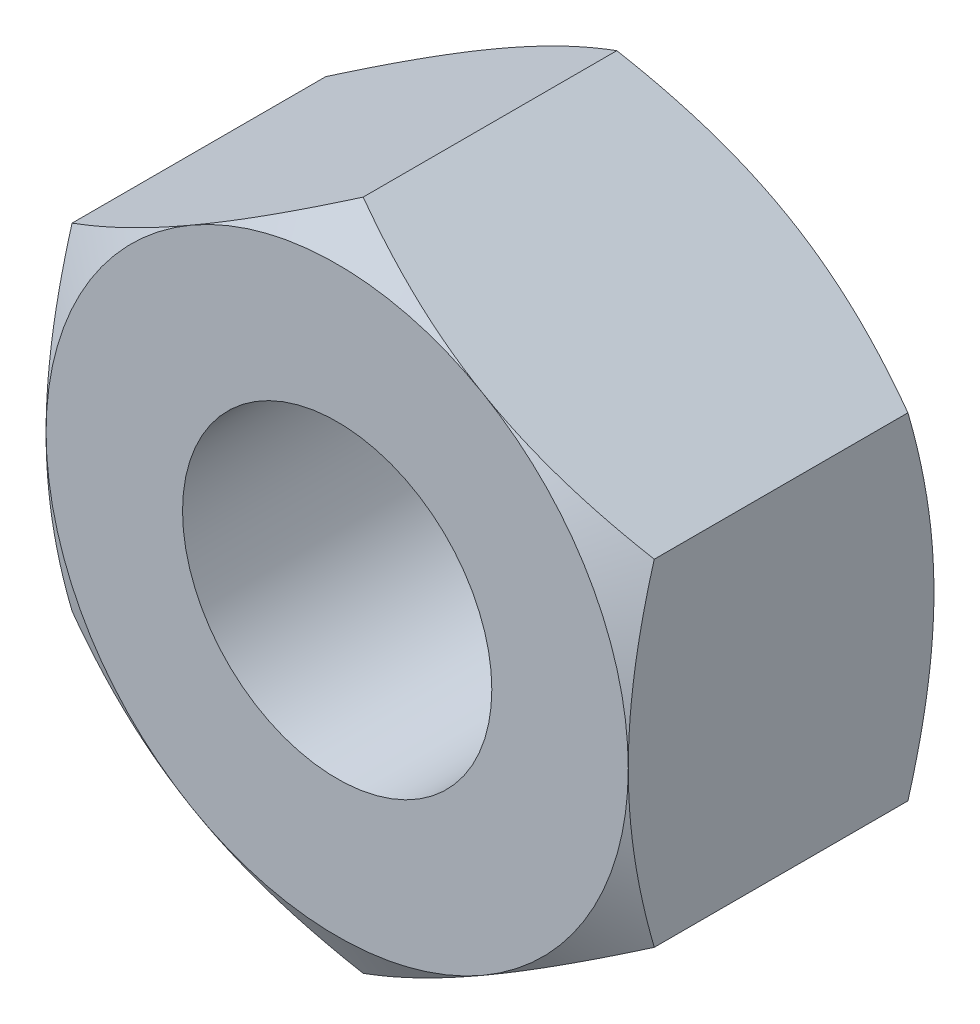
from build123d import *

# Parameters (mm, degrees)
BASE_EXTRUSION_DEPTH   = 8.4
TROU_TARAUD_M10X1_51_D = 8.5


with BuildPart() as part:
    # Esquisse1 → Base-Extrusion (new body)
    with BuildSketch(Plane.XY):
        Polygon((8, 4.618802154), (0, 9.237604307), (-8, 4.618802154), (-8, -4.618802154), (0, -9.237604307), (8, -4.618802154), align=None)
    extrude(amount=BASE_EXTRUSION_DEPTH)

    # Esquisse4 → Enl_vement de mati_re-R_volution1 (revolve, cut)
    with BuildSketch(Plane(origin=(0, 0, 0), x_dir=(0, 0, -1), z_dir=(1, 0, 0)), mode=Mode.PRIVATE) as enl_vement_de_mati_re_r_volution1_sk:
        Polygon((-0.71453118, 9.237604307), (0, 9.237604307), (0, 8), align=None)
        Polygon((-8.4, 9.237604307), (-7.68546882, 9.237604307), (-8.4, 8), align=None)
    revolve(enl_vement_de_mati_re_r_volution1_sk.sketch.rotate(Axis((0, 0, -2.764517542), (0, 0, 1)), 90), axis=Axis((0, 0, -2.764517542), (0, 0, 1)), mode=Mode.SUBTRACT)

    # Trou taraud_ M10x1.51 (through all)
    with Locations(Plane(origin=(0, 0, 0), x_dir=(-1, 0, 0), z_dir=(0, 0, -1))):
        with Locations((0, 0)):
            Hole(TROU_TARAUD_M10X1_51_D / 2)


solid = part.part
